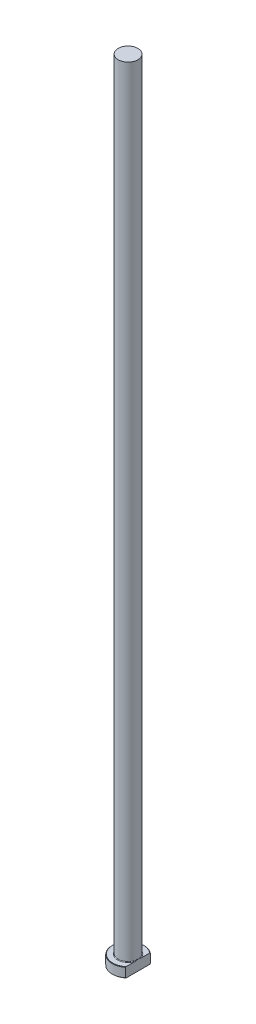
ISO-10303-21;
HEADER;
FILE_DESCRIPTION(('STEP AP214'),'2;1');
FILE_NAME('part.step','',(''),(''),'','','');
FILE_SCHEMA(('AUTOMOTIVE_DESIGN { 1 0 10303 214 1 1 1 1 }'));
ENDSEC;
DATA;
#1=APPLICATION_CONTEXT('core data for automotive mechanical design processes');
#2=APPLICATION_PROTOCOL_DEFINITION('international standard','automotive_design',2000,#1);
#3=PRODUCT_CONTEXT('',#1,'mechanical');
#4=PRODUCT('Part','Part','',(#3));
#5=PRODUCT_RELATED_PRODUCT_CATEGORY('part','',(#4));
#6=PRODUCT_DEFINITION_FORMATION('','',#4);
#7=PRODUCT_DEFINITION_CONTEXT('part definition',#1,'design');
#8=PRODUCT_DEFINITION('design','',#6,#7);
#9=PRODUCT_DEFINITION_SHAPE('','',#8);
#10=(LENGTH_UNIT() NAMED_UNIT(*) SI_UNIT(.MILLI.,.METRE.));
#11=(NAMED_UNIT(*) PLANE_ANGLE_UNIT() SI_UNIT($,.RADIAN.));
#12=(NAMED_UNIT(*) SI_UNIT($,.STERADIAN.) SOLID_ANGLE_UNIT());
#13=UNCERTAINTY_MEASURE_WITH_UNIT(LENGTH_MEASURE(1.E-05),#10,'distance_accuracy_value','');
#14=(GEOMETRIC_REPRESENTATION_CONTEXT(3) GLOBAL_UNCERTAINTY_ASSIGNED_CONTEXT((#13)) GLOBAL_UNIT_ASSIGNED_CONTEXT((#10,
#11,#12)) REPRESENTATION_CONTEXT('',''));
#15=CARTESIAN_POINT('',(0.,0.,0.));
#16=DIRECTION('',(0.,0.,1.));
#17=DIRECTION('',(1.,0.,0.));
#18=AXIS2_PLACEMENT_3D('',#15,#16,#17);
#19=CARTESIAN_POINT('',(0.,0.,0.));
#20=DIRECTION('',(0.,-1.,0.));
#21=DIRECTION('',(0.,0.,-1.));
#22=AXIS2_PLACEMENT_3D('',#19,#20,#21);
#23=PLANE('',#22);
#24=CARTESIAN_POINT('',(0.,0.,0.));
#25=DIRECTION('',(0.,-1.,0.));
#26=DIRECTION('',(0.,0.,-1.));
#27=AXIS2_PLACEMENT_3D('',#24,#25,#26);
#28=CIRCLE('',#27,7.79999999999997);
#29=CARTESIAN_POINT('',(4.99999999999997,0.,5.9866518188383));
#30=VERTEX_POINT('',#29);
#31=CARTESIAN_POINT('',(4.99999999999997,0.,-5.9866518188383));
#32=VERTEX_POINT('',#31);
#33=EDGE_CURVE('E98',#30,#32,#28,.T.);
#34=ORIENTED_EDGE('',*,*,#33,.T.);
#35=DIRECTION('',(0.,0.,1.));
#36=VECTOR('',#35,1.);
#37=CARTESIAN_POINT('',(4.99999999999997,0.,-6.24499799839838));
#38=LINE('',#37,#36);
#39=EDGE_CURVE('E83',#32,#30,#38,.T.);
#40=ORIENTED_EDGE('',*,*,#39,.T.);
#41=EDGE_LOOP('',(#34,#40));
#42=FACE_BOUND('',#41,.T.);
#43=ADVANCED_FACE('F32',(#42),#23,.T.);
#44=CARTESIAN_POINT('',(0.,259.958771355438,0.));
#45=DIRECTION('',(0.,1.,0.));
#46=DIRECTION('',(0.,0.,1.));
#47=AXIS2_PLACEMENT_3D('',#44,#45,#46);
#48=CYLINDRICAL_SURFACE('',#47,7.99999999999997);
#49=CARTESIAN_POINT('',(0.,4.79999999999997,0.));
#50=DIRECTION('',(0.,1.,0.));
#51=DIRECTION('',(0.,0.,1.));
#52=AXIS2_PLACEMENT_3D('',#49,#50,#51);
#53=CIRCLE('',#52,7.99999999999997);
#54=CARTESIAN_POINT('',(4.99999999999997,4.79999999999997,6.24499799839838));
#55=VERTEX_POINT('',#54);
#56=CARTESIAN_POINT('',(4.99999999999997,4.79999999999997,-6.24499799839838));
#57=VERTEX_POINT('',#56);
#58=EDGE_CURVE('E104',#55,#57,#53,.F.);
#59=ORIENTED_EDGE('',*,*,#58,.T.);
#60=DIRECTION('',(0.,-1.,0.));
#61=VECTOR('',#60,1.);
#62=CARTESIAN_POINT('',(4.99999999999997,400.,-6.24499799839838));
#63=LINE('',#62,#61);
#64=CARTESIAN_POINT('',(4.99999999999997,0.199999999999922,-6.24499799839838));
#65=VERTEX_POINT('',#64);
#66=EDGE_CURVE('E183',#57,#65,#63,.T.);
#67=ORIENTED_EDGE('',*,*,#66,.T.);
#68=CARTESIAN_POINT('',(0.,0.199999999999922,0.));
#69=DIRECTION('',(0.,-1.,0.));
#70=DIRECTION('',(0.,0.,-1.));
#71=AXIS2_PLACEMENT_3D('',#68,#69,#70);
#72=CIRCLE('',#71,7.99999999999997);
#73=CARTESIAN_POINT('',(4.99999999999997,0.199999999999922,6.24499799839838));
#74=VERTEX_POINT('',#73);
#75=EDGE_CURVE('E100',#65,#74,#72,.F.);
#76=ORIENTED_EDGE('',*,*,#75,.T.);
#77=DIRECTION('',(0.,-1.,0.));
#78=VECTOR('',#77,1.);
#79=CARTESIAN_POINT('',(4.99999999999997,400.,6.24499799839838));
#80=LINE('',#79,#78);
#81=EDGE_CURVE('E93',#55,#74,#80,.T.);
#82=ORIENTED_EDGE('',*,*,#81,.F.);
#83=EDGE_LOOP('',(#59,#67,#76,#82));
#84=FACE_BOUND('',#83,.T.);
#85=ADVANCED_FACE('F158',(#84),#48,.T.);
#86=CARTESIAN_POINT('',(-7.99999999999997,5.,0.));
#87=DIRECTION('',(0.,1.,0.));
#88=DIRECTION('',(0.,0.,1.));
#89=AXIS2_PLACEMENT_3D('',#86,#87,#88);
#90=PLANE('',#89);
#91=CARTESIAN_POINT('',(0.,5.,0.));
#92=DIRECTION('',(0.,1.,0.));
#93=DIRECTION('',(0.,0.,1.));
#94=AXIS2_PLACEMENT_3D('',#91,#92,#93);
#95=CIRCLE('',#94,7.79999999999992);
#96=CARTESIAN_POINT('',(4.99999999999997,5.,-5.98665181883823));
#97=VERTEX_POINT('',#96);
#98=CARTESIAN_POINT('',(4.99999999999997,5.,5.98665181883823));
#99=VERTEX_POINT('',#98);
#100=EDGE_CURVE('E178',#97,#99,#95,.T.);
#101=ORIENTED_EDGE('',*,*,#100,.T.);
#102=DIRECTION('',(0.,0.,-1.));
#103=VECTOR('',#102,1.);
#104=CARTESIAN_POINT('',(4.99999999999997,5.,0.));
#105=LINE('',#104,#103);
#106=CARTESIAN_POINT('',(4.99999999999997,4.99999999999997,1.75783958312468));
#107=VERTEX_POINT('',#106);
#108=EDGE_CURVE('E57',#99,#107,#105,.T.);
#109=ORIENTED_EDGE('',*,*,#108,.T.);
#110=CARTESIAN_POINT('',(0.,5.,0.));
#111=DIRECTION('',(0.,1.,0.));
#112=DIRECTION('',(0.,0.,1.));
#113=AXIS2_PLACEMENT_3D('',#110,#111,#112);
#114=CIRCLE('',#113,5.29999999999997);
#115=CARTESIAN_POINT('',(4.99999999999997,4.99999999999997,-1.75783958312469));
#116=VERTEX_POINT('',#115);
#117=EDGE_CURVE('E107',#107,#116,#114,.F.);
#118=ORIENTED_EDGE('',*,*,#117,.T.);
#119=EDGE_CURVE('E136',#116,#97,#105,.T.);
#120=ORIENTED_EDGE('',*,*,#119,.T.);
#121=EDGE_LOOP('',(#101,#109,#118,#120));
#122=FACE_BOUND('',#121,.T.);
#123=ADVANCED_FACE('F147',(#122),#90,.T.);
#124=CARTESIAN_POINT('',(0.,5.,0.));
#125=DIRECTION('',(0.,-1.,0.));
#126=DIRECTION('',(0.,0.,-1.));
#127=AXIS2_PLACEMENT_3D('',#124,#125,#126);
#128=CONICAL_SURFACE('',#127,7.79999999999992,0.785398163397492);
#129=ORIENTED_EDGE('',*,*,#58,.F.);
#130=CARTESIAN_POINT('',(4.99999999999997,-1.82162423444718,13.7401563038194));
#131=CARTESIAN_POINT('',(4.99999999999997,-1.61889813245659,13.5244204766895));
#132=CARTESIAN_POINT('',(4.99999999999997,-1.41646387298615,13.3084101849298));
#133=CARTESIAN_POINT('',(4.99999999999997,-1.01227657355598,12.8757508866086));
#134=CARTESIAN_POINT('',(4.99999999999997,-0.810523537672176,12.65910187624));
#135=CARTESIAN_POINT('',(4.99999999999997,-0.206157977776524,12.0077661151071));
#136=CARTESIAN_POINT('',(4.99999999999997,0.195280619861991,11.571988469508));
#137=CARTESIAN_POINT('',(4.99999999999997,1.00388282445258,10.6856136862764));
#138=CARTESIAN_POINT('',(4.99999999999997,1.41093902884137,10.234918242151));
#139=CARTESIAN_POINT('',(4.99999999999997,2.01658324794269,9.55471676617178));
#140=CARTESIAN_POINT('',(4.99999999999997,2.21758236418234,9.32735800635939));
#141=CARTESIAN_POINT('',(4.99999999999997,2.61761142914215,8.87091599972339));
#142=CARTESIAN_POINT('',(4.99999999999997,2.81664139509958,8.64183276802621));
#143=CARTESIAN_POINT('',(4.99999999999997,3.2121734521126,8.18170099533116));
#144=CARTESIAN_POINT('',(4.99999999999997,3.40867681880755,7.95065355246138));
#145=CARTESIAN_POINT('',(4.99999999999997,3.79865427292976,7.48599989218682));
#146=CARTESIAN_POINT('',(4.99999999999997,3.99212827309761,7.25239360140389));
#147=CARTESIAN_POINT('',(4.99999999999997,4.37558160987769,6.78155890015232));
#148=CARTESIAN_POINT('',(4.99999999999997,4.56555334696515,6.54432428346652));
#149=CARTESIAN_POINT('',(4.99999999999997,4.94042138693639,6.065895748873));
#150=CARTESIAN_POINT('',(4.99999999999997,5.12531810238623,5.82470215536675));
#151=CARTESIAN_POINT('',(4.99999999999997,5.48653546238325,5.33972956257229));
#152=CARTESIAN_POINT('',(4.99999999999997,5.66292392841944,5.09600137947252));
#153=CARTESIAN_POINT('',(4.99999999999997,6.00675382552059,4.60213647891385));
#154=CARTESIAN_POINT('',(4.99999999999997,6.17419169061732,4.35199726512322));
#155=CARTESIAN_POINT('',(4.99999999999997,6.49592993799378,3.84445040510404));
#156=CARTESIAN_POINT('',(4.99999999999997,6.65027272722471,3.58707012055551));
#157=CARTESIAN_POINT('',(4.99999999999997,6.86813414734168,3.1935659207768));
#158=CARTESIAN_POINT('',(4.99999999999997,6.93845533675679,3.06120993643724));
#159=CARTESIAN_POINT('',(4.99999999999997,7.07360441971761,2.79373319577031));
#160=CARTESIAN_POINT('',(4.99999999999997,7.1384331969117,2.65861288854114));
#161=CARTESIAN_POINT('',(4.99999999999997,7.26869642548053,2.3693638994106));
#162=CARTESIAN_POINT('',(4.99999999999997,7.33331212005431,2.21486278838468));
#163=CARTESIAN_POINT('',(4.99999999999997,7.45243473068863,1.90194073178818));
#164=CARTESIAN_POINT('',(4.99999999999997,7.50694001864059,1.74351915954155));
#165=CARTESIAN_POINT('',(4.99999999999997,7.60343746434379,1.42384276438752));
#166=CARTESIAN_POINT('',(4.99999999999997,7.64549910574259,1.26260921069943));
#167=CARTESIAN_POINT('',(4.99999999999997,7.71543089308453,0.937062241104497));
#168=CARTESIAN_POINT('',(4.99999999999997,7.74330266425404,0.77274918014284));
#169=CARTESIAN_POINT('',(4.99999999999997,7.78344284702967,0.439876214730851));
#170=CARTESIAN_POINT('',(4.99999999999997,7.79548961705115,0.271289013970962));
#171=CARTESIAN_POINT('',(4.99999999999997,7.80240809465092,-0.0662275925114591));
#172=CARTESIAN_POINT('',(4.99999999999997,7.79728142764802,-0.235156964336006));
#173=CARTESIAN_POINT('',(4.99999999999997,7.77017954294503,-0.572209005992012));
#174=CARTESIAN_POINT('',(4.99999999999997,7.74814735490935,-0.740327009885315));
#175=CARTESIAN_POINT('',(4.99999999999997,7.68863212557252,-1.07379849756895));
#176=CARTESIAN_POINT('',(4.99999999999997,7.65114437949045,-1.23915112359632));
#177=CARTESIAN_POINT('',(4.99999999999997,7.54734433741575,-1.62344926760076));
#178=CARTESIAN_POINT('',(4.99999999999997,7.47553580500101,-1.84089917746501));
#179=CARTESIAN_POINT('',(4.99999999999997,7.31300119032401,-2.26856946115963));
#180=CARTESIAN_POINT('',(4.99999999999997,7.22226460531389,-2.4787857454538));
#181=CARTESIAN_POINT('',(4.99999999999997,7.07492970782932,-2.79014067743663));
#182=CARTESIAN_POINT('',(4.99999999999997,7.02362278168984,-2.89384077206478));
#183=CARTESIAN_POINT('',(4.99999999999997,6.91783840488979,-3.0996162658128));
#184=CARTESIAN_POINT('',(4.99999999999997,6.86336091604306,-3.2016916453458));
#185=CARTESIAN_POINT('',(4.99999999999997,6.75169048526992,-3.40428995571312));
#186=CARTESIAN_POINT('',(4.99999999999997,6.69449856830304,-3.50481345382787));
#187=CARTESIAN_POINT('',(4.99999999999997,6.57774196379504,-3.70446206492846));
#188=CARTESIAN_POINT('',(4.99999999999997,6.51817739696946,-3.80358724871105));
#189=CARTESIAN_POINT('',(4.99999999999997,6.30853654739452,-4.1443576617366));
#190=CARTESIAN_POINT('',(4.99999999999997,6.15326588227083,-4.38281352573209));
#191=CARTESIAN_POINT('',(4.99999999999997,5.83377190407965,-4.85367607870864));
#192=CARTESIAN_POINT('',(4.99999999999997,5.66954595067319,-5.08608095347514));
#193=CARTESIAN_POINT('',(4.99999999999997,5.33431698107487,-5.54628554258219));
#194=CARTESIAN_POINT('',(4.99999999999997,5.16330740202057,-5.77408045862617));
#195=CARTESIAN_POINT('',(4.99999999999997,4.81629923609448,-6.22578157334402));
#196=CARTESIAN_POINT('',(4.99999999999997,4.64030119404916,-6.44968819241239));
#197=CARTESIAN_POINT('',(4.99999999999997,4.28368615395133,-6.89532578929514));
#198=CARTESIAN_POINT('',(4.99999999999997,4.1030528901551,-7.11704371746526));
#199=CARTESIAN_POINT('',(4.99999999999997,3.73870710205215,-7.55793799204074));
#200=CARTESIAN_POINT('',(4.99999999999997,3.55499450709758,-7.77711427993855));
#201=CARTESIAN_POINT('',(4.99999999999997,3.18521083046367,-8.21325328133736));
#202=CARTESIAN_POINT('',(4.99999999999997,2.99914113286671,-8.43021717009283));
#203=CARTESIAN_POINT('',(4.99999999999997,2.62499812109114,-8.86241167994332));
#204=CARTESIAN_POINT('',(4.99999999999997,2.43692478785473,-9.07764228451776));
#205=CARTESIAN_POINT('',(4.99999999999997,1.91463404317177,-9.67075518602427));
#206=CARTESIAN_POINT('',(4.99999999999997,1.57868086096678,-10.0471086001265));
#207=CARTESIAN_POINT('',(4.99999999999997,0.903003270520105,-10.7965122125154));
#208=CARTESIAN_POINT('',(4.99999999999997,0.563278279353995,-11.1695618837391));
#209=CARTESIAN_POINT('',(4.99999999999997,-0.116149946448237,-11.9100168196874));
#210=CARTESIAN_POINT('',(4.99999999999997,-0.455830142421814,-12.2774432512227));
#211=CARTESIAN_POINT('',(4.99999999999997,-1.1372864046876,-13.0102135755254));
#212=CARTESIAN_POINT('',(4.99999999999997,-1.47906204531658,-13.3755578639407));
#213=CARTESIAN_POINT('',(4.99999999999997,-1.82162423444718,-13.7401563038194));
#214=B_SPLINE_CURVE_WITH_KNOTS('',3,(#130,#131,#132,#133,#134,#135,#136,#137,#138,#139,#140,
#141,#142,#143,#144,#145,#146,#147,#148,#149,#150,#151,#152,#153,#154,#155,#156,#157,#158,#159,
#160,#161,#162,#163,#164,#165,#166,#167,#168,#169,#170,#171,#172,#173,#174,#175,#176,#177,#178,
#179,#180,#181,#182,#183,#184,#185,#186,#187,#188,#189,#190,#191,#192,#193,#194,#195,#196,#197,
#198,#199,#200,#201,#202,#203,#204,#205,#206,#207,#208,#209,#210,#211,#212,#213),.UNSPECIFIED.,
.F.,.F.,(4,2,2,2,2,2,2,2,2,2,2,2,2,2,2,2,2,2,2,2,2,2,2,2,2,2,2,2,2,2,2,2,2,2,2,2,2,2,2,2,2,4),
(0.,0.888120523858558,1.77624635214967,3.55372511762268,5.37559481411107,6.28598924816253,
7.19637570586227,8.10628289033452,9.01621623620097,9.92793449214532,10.8395784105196,
11.7420025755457,12.6447836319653,13.5445196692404,13.9940505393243,14.4435089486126,
14.9456212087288,15.4478142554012,15.947147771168,16.4464240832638,16.9526211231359,
17.4587702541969,17.966632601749,18.4746496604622,19.1604516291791,19.8466351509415,
20.1936870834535,20.5407431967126,20.8876692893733,21.2345777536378,22.0879097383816,
22.9414946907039,23.79592661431,24.6502655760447,25.5081848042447,26.3661237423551,
27.2235803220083,28.0810450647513,29.5944656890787,31.1081235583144,32.6092678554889,
34.1101167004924),.UNSPECIFIED.);
#215=EDGE_CURVE('E135',#55,#99,#214,.T.);
#216=ORIENTED_EDGE('',*,*,#215,.T.);
#217=ORIENTED_EDGE('',*,*,#100,.F.);
#218=EDGE_CURVE('E127',#97,#57,#214,.T.);
#219=ORIENTED_EDGE('',*,*,#218,.T.);
#220=EDGE_LOOP('',(#129,#216,#217,#219));
#221=FACE_BOUND('',#220,.T.);
#222=ADVANCED_FACE('F143',(#221),#128,.T.);
#223=CARTESIAN_POINT('',(0.,0.199999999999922,0.));
#224=DIRECTION('',(0.,1.,0.));
#225=DIRECTION('',(0.,0.,1.));
#226=AXIS2_PLACEMENT_3D('',#223,#224,#225);
#227=CONICAL_SURFACE('',#226,7.99999999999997,0.78539816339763);
#228=ORIENTED_EDGE('',*,*,#75,.F.);
#229=CARTESIAN_POINT('',(4.99999999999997,6.82162423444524,-13.7401563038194));
#230=CARTESIAN_POINT('',(4.99999999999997,6.61889813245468,-13.5244204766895));
#231=CARTESIAN_POINT('',(4.99999999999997,6.41646387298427,-13.3084101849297));
#232=CARTESIAN_POINT('',(4.99999999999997,6.01227657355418,-12.8757508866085));
#233=CARTESIAN_POINT('',(4.99999999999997,5.81052353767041,-12.6591018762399));
#234=CARTESIAN_POINT('',(4.99999999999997,5.20615797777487,-12.0077661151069));
#235=CARTESIAN_POINT('',(4.99999999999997,4.80471938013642,-11.5719884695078));
#236=CARTESIAN_POINT('',(4.99999999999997,3.99611717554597,-10.685613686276));
#237=CARTESIAN_POINT('',(4.99999999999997,3.58906097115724,-10.2349182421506));
#238=CARTESIAN_POINT('',(4.99999999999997,2.98341675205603,-9.55471676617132));
#239=CARTESIAN_POINT('',(4.99999999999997,2.7824176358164,-9.3273580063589));
#240=CARTESIAN_POINT('',(4.99999999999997,2.38238857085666,-8.87091599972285));
#241=CARTESIAN_POINT('',(4.99999999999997,2.18335860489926,-8.64183276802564));
#242=CARTESIAN_POINT('',(4.99999999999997,1.78782654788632,-8.18170099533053));
#243=CARTESIAN_POINT('',(4.99999999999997,1.59132318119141,-7.95065355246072));
#244=CARTESIAN_POINT('',(4.99999999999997,1.20134572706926,-7.48599989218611));
#245=CARTESIAN_POINT('',(4.99999999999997,1.00787172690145,-7.25239360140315));
#246=CARTESIAN_POINT('',(4.99999999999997,0.624418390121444,-6.78155890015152));
#247=CARTESIAN_POINT('',(4.99999999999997,0.434446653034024,-6.5443242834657));
#248=CARTESIAN_POINT('',(4.99999999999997,0.0595786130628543,-6.06589574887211));
#249=CARTESIAN_POINT('',(4.99999999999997,-0.125318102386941,-5.82470215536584));
#250=CARTESIAN_POINT('',(4.99999999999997,-0.486535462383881,-5.33972956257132));
#251=CARTESIAN_POINT('',(4.99999999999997,-0.662923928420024,-5.09600137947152));
#252=CARTESIAN_POINT('',(4.99999999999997,-1.00675382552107,-4.60213647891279));
#253=CARTESIAN_POINT('',(4.99999999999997,-1.17419169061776,-4.35199726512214));
#254=CARTESIAN_POINT('',(4.99999999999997,-1.49592993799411,-3.84445040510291));
#255=CARTESIAN_POINT('',(4.99999999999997,-1.65027272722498,-3.58707012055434));
#256=CARTESIAN_POINT('',(4.99999999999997,-1.86813414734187,-3.19356592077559));
#257=CARTESIAN_POINT('',(4.99999999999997,-1.93845533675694,-3.06120993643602));
#258=CARTESIAN_POINT('',(4.99999999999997,-2.07360441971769,-2.79373319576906));
#259=CARTESIAN_POINT('',(4.99999999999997,-2.13843319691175,-2.65861288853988));
#260=CARTESIAN_POINT('',(4.99999999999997,-2.26869642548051,-2.3693638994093));
#261=CARTESIAN_POINT('',(4.99999999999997,-2.33331212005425,-2.21486278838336));
#262=CARTESIAN_POINT('',(4.99999999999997,-2.45243473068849,-1.90194073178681));
#263=CARTESIAN_POINT('',(4.99999999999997,-2.50694001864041,-1.74351915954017));
#264=CARTESIAN_POINT('',(4.99999999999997,-2.60343746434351,-1.42384276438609));
#265=CARTESIAN_POINT('',(4.99999999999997,-2.64549910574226,-1.26260921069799));
#266=CARTESIAN_POINT('',(4.99999999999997,-2.7154308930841,-0.937062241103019));
#267=CARTESIAN_POINT('',(4.99999999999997,-2.74330266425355,-0.772749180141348));
#268=CARTESIAN_POINT('',(4.99999999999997,-2.78344284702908,-0.43987621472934));
#269=CARTESIAN_POINT('',(4.99999999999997,-2.79548961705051,-0.271289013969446));
#270=CARTESIAN_POINT('',(4.99999999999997,-2.80240809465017,0.0662275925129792));
#271=CARTESIAN_POINT('',(4.99999999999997,-2.79728142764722,0.235156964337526));
#272=CARTESIAN_POINT('',(4.99999999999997,-2.77017954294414,0.572209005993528));
#273=CARTESIAN_POINT('',(4.99999999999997,-2.74814735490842,0.740327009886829));
#274=CARTESIAN_POINT('',(4.99999999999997,-2.6886321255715,1.07379849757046));
#275=CARTESIAN_POINT('',(4.99999999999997,-2.65114437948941,1.23915112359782));
#276=CARTESIAN_POINT('',(4.99999999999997,-2.54734433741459,1.62344926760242));
#277=CARTESIAN_POINT('',(4.99999999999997,-2.47553580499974,1.84089917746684));
#278=CARTESIAN_POINT('',(4.99999999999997,-2.31300119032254,2.26856946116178));
#279=CARTESIAN_POINT('',(4.99999999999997,-2.22226460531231,2.4787857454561));
#280=CARTESIAN_POINT('',(4.99999999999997,-2.07492970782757,2.79014067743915));
#281=CARTESIAN_POINT('',(4.99999999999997,-2.02362278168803,2.89384077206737));
#282=CARTESIAN_POINT('',(4.99999999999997,-1.91783840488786,3.09961626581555));
#283=CARTESIAN_POINT('',(4.99999999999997,-1.86336091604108,3.20169164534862));
#284=CARTESIAN_POINT('',(4.99999999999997,-1.75169048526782,3.40428995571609));
#285=CARTESIAN_POINT('',(4.99999999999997,-1.69449856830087,3.50481345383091));
#286=CARTESIAN_POINT('',(4.99999999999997,-1.57774196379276,3.70446206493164));
#287=CARTESIAN_POINT('',(4.99999999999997,-1.51817739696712,3.80358724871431));
#288=CARTESIAN_POINT('',(4.99999999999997,-1.30853654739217,4.14435766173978));
#289=CARTESIAN_POINT('',(4.99999999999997,-1.15326588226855,4.38281352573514));
#290=CARTESIAN_POINT('',(4.99999999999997,-0.833771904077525,4.85367607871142));
#291=CARTESIAN_POINT('',(4.99999999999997,-0.669545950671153,5.0860809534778));
#292=CARTESIAN_POINT('',(4.99999999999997,-0.334316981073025,5.54628554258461));
#293=CARTESIAN_POINT('',(4.99999999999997,-0.163307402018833,5.77408045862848));
#294=CARTESIAN_POINT('',(4.99999999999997,0.183700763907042,6.2257815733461));
#295=CARTESIAN_POINT('',(4.99999999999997,0.359698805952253,6.44968819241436));
#296=CARTESIAN_POINT('',(4.99999999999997,0.716313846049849,6.8953257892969));
#297=CARTESIAN_POINT('',(4.99999999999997,0.896947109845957,7.11704371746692));
#298=CARTESIAN_POINT('',(4.99999999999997,1.26129289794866,7.55793799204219));
#299=CARTESIAN_POINT('',(4.99999999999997,1.44500549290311,7.7771142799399));
#300=CARTESIAN_POINT('',(4.99999999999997,1.81478916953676,8.21325328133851));
#301=CARTESIAN_POINT('',(4.99999999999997,2.00085886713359,8.43021717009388));
#302=CARTESIAN_POINT('',(4.99999999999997,2.3750018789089,8.86241167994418));
#303=CARTESIAN_POINT('',(4.99999999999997,2.56307521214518,9.07764228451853));
#304=CARTESIAN_POINT('',(4.99999999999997,3.08536595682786,9.67075518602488));
#305=CARTESIAN_POINT('',(4.99999999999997,3.42131913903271,10.047108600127));
#306=CARTESIAN_POINT('',(4.99999999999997,4.09699672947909,10.7965122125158));
#307=CARTESIAN_POINT('',(4.99999999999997,4.43672172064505,11.1695618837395));
#308=CARTESIAN_POINT('',(4.99999999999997,5.11614994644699,11.9100168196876));
#309=CARTESIAN_POINT('',(4.99999999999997,5.45583014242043,12.2774432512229));
#310=CARTESIAN_POINT('',(4.99999999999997,6.13728640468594,13.0102135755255));
#311=CARTESIAN_POINT('',(4.99999999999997,6.47906204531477,13.3755578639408));
#312=CARTESIAN_POINT('',(4.99999999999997,6.82162423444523,13.7401563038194));
#313=B_SPLINE_CURVE_WITH_KNOTS('',3,(#229,#230,#231,#232,#233,#234,#235,#236,#237,#238,#239,
#240,#241,#242,#243,#244,#245,#246,#247,#248,#249,#250,#251,#252,#253,#254,#255,#256,#257,#258,
#259,#260,#261,#262,#263,#264,#265,#266,#267,#268,#269,#270,#271,#272,#273,#274,#275,#276,#277,
#278,#279,#280,#281,#282,#283,#284,#285,#286,#287,#288,#289,#290,#291,#292,#293,#294,#295,#296,
#297,#298,#299,#300,#301,#302,#303,#304,#305,#306,#307,#308,#309,#310,#311,#312),.UNSPECIFIED.,
.F.,.F.,(4,2,2,2,2,2,2,2,2,2,2,2,2,2,2,2,2,2,2,2,2,2,2,2,2,2,2,2,2,2,2,2,2,2,2,2,2,2,2,2,2,4),
(0.,0.888120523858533,1.77624635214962,3.55372511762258,5.37559481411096,6.28598924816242,
7.19637570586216,8.1062828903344,9.01621623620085,9.9279344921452,10.8395784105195,
11.7420025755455,12.6447836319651,13.5445196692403,13.9940505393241,14.4435089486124,
14.9456212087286,15.447814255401,15.9471477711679,16.4464240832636,16.9526211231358,
17.4587702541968,17.9666326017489,18.4746496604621,19.1604516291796,19.8466351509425,
20.1936870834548,20.5407431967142,20.8876692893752,21.2345777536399,22.0879097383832,
22.9414946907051,23.7959266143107,24.650265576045,25.5081848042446,26.3661237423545,
27.2235803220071,28.0810450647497,29.5944656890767,31.108123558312,32.609267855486,
34.1101167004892),.UNSPECIFIED.);
#314=EDGE_CURVE('E86',#65,#32,#313,.T.);
#315=ORIENTED_EDGE('',*,*,#314,.T.);
#316=ORIENTED_EDGE('',*,*,#33,.F.);
#317=EDGE_CURVE('E89',#30,#74,#313,.T.);
#318=ORIENTED_EDGE('',*,*,#317,.T.);
#319=EDGE_LOOP('',(#228,#315,#316,#318));
#320=FACE_BOUND('',#319,.T.);
#321=ADVANCED_FACE('F97',(#320),#227,.T.);
#322=CARTESIAN_POINT('',(0.,5.29999999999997,0.));
#323=DIRECTION('',(0.,1.,0.));
#324=DIRECTION('',(0.,0.,1.));
#325=AXIS2_PLACEMENT_3D('',#322,#323,#324);
#326=TOROIDAL_SURFACE('',#325,5.29999999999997,0.3);
#327=CARTESIAN_POINT('',(4.99999999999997,5.29999999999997,0.));
#328=CARTESIAN_POINT('',(4.99999999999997,5.30000062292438,1.31469639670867E-10));
#329=CARTESIAN_POINT('',(4.99999999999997,5.30000124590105,-2.52759209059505E-07));
#330=CARTESIAN_POINT('',(4.99999999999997,5.30000240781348,-9.47164325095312E-07));
#331=CARTESIAN_POINT('',(4.99999999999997,5.30000293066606,-1.40594036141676E-06));
#332=CARTESIAN_POINT('',(4.99999999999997,5.30000402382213,-2.50637603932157E-06));
#333=CARTESIAN_POINT('',(4.99999999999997,5.30000457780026,-3.16588904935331E-06));
#334=CARTESIAN_POINT('',(4.99999999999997,5.30000556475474,-4.52859961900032E-06));
#335=CARTESIAN_POINT('',(4.99999999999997,5.30000600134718,-5.22939444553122E-06));
#336=CARTESIAN_POINT('',(4.99999999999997,5.30000763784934,-7.9612197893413E-06));
#337=CARTESIAN_POINT('',(4.99999999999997,5.30000875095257,-1.0047740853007E-05));
#338=CARTESIAN_POINT('',(4.99999999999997,5.3000105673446,-1.4166087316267E-05));
#339=CARTESIAN_POINT('',(4.99999999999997,5.30001129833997,-1.6186178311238E-05));
#340=CARTESIAN_POINT('',(4.99999999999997,5.30001439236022,-2.47865739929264E-05));
#341=CARTESIAN_POINT('',(4.99999999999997,5.30001672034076,-3.13830281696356E-05));
#342=CARTESIAN_POINT('',(4.99999999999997,5.30002012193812,-4.38084218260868E-05));
#343=CARTESIAN_POINT('',(4.99999999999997,5.30002133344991,-4.95992737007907E-05));
#344=CARTESIAN_POINT('',(4.99999999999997,5.30003020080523,-9.27862610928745E-05));
#345=CARTESIAN_POINT('',(4.99999999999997,5.30003696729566,-0.000130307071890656));
#346=CARTESIAN_POINT('',(4.99999999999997,5.30006659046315,-0.000278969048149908));
#347=CARTESIAN_POINT('',(4.99999999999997,5.30009481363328,-0.000389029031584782));
#348=CARTESIAN_POINT('',(4.99999999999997,5.30020506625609,-0.000826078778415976));
#349=CARTESIAN_POINT('',(4.99999999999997,5.30028365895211,-0.00115365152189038));
#350=CARTESIAN_POINT('',(4.99999999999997,5.3005991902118,-0.00245925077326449));
#351=CARTESIAN_POINT('',(4.99999999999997,5.30084048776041,-0.00343651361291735));
#352=CARTESIAN_POINT('',(4.99999999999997,5.30184626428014,-0.00752058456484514));
#353=CARTESIAN_POINT('',(4.99999999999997,5.30260525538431,-0.0106283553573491));
#354=CARTESIAN_POINT('',(4.99999999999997,5.30996461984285,-0.0407482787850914));
#355=CARTESIAN_POINT('',(4.99999999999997,5.31658985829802,-0.0677561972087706));
#356=CARTESIAN_POINT('',(4.99999999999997,5.32953319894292,-0.120688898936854));
#357=CARTESIAN_POINT('',(4.99999999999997,5.33585289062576,-0.146613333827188));
#358=CARTESIAN_POINT('',(4.99999999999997,5.34926050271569,-0.201795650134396));
#359=CARTESIAN_POINT('',(4.99999999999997,5.35634306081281,-0.231054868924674));
#360=CARTESIAN_POINT('',(4.99999999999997,5.37050252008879,-0.289917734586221));
#361=CARTESIAN_POINT('',(4.99999999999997,5.37757848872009,-0.319521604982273));
#362=CARTESIAN_POINT('',(4.99999999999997,5.39452602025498,-0.391032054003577));
#363=CARTESIAN_POINT('',(4.99999999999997,5.40434071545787,-0.432952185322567));
#364=CARTESIAN_POINT('',(4.99999999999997,5.42340141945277,-0.515763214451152));
#365=CARTESIAN_POINT('',(4.99999999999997,5.43265559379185,-0.556652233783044));
#366=CARTESIAN_POINT('',(4.99999999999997,5.45710553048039,-0.667075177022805));
#367=CARTESIAN_POINT('',(4.99999999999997,5.47194176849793,-0.736689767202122));
#368=CARTESIAN_POINT('',(4.99999999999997,5.50018229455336,-0.876836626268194));
#369=CARTESIAN_POINT('',(4.99999999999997,5.51357312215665,-0.947371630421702));
#370=CARTESIAN_POINT('',(4.99999999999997,5.53930921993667,-1.09497328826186));
#371=CARTESIAN_POINT('',(4.99999999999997,5.55146217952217,-1.17207432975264));
#372=CARTESIAN_POINT('',(4.99999999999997,5.57239669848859,-1.32672649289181));
#373=CARTESIAN_POINT('',(4.99999999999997,5.58117877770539,-1.40427754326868));
#374=CARTESIAN_POINT('',(4.99999999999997,5.594997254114,-1.5687382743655));
#375=CARTESIAN_POINT('',(4.99999999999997,5.59948802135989,-1.65570044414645));
#376=CARTESIAN_POINT('',(4.99999999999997,5.60018885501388,-1.78535304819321));
#377=CARTESIAN_POINT('',(4.99999999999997,5.59945214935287,-1.82802575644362));
#378=CARTESIAN_POINT('',(4.99999999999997,5.59559364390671,-1.91325081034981));
#379=CARTESIAN_POINT('',(4.99999999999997,5.59247319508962,-1.95580321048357));
#380=CARTESIAN_POINT('',(4.99999999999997,5.5838324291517,-2.03512365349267));
#381=CARTESIAN_POINT('',(4.99999999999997,5.57867386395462,-2.07192937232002));
#382=CARTESIAN_POINT('',(4.99999999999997,5.56543793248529,-2.1452675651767));
#383=CARTESIAN_POINT('',(4.99999999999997,5.55734203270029,-2.18179676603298));
#384=CARTESIAN_POINT('',(4.99999999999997,5.53718005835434,-2.25427226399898));
#385=CARTESIAN_POINT('',(4.99999999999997,5.52507057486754,-2.29020746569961));
#386=CARTESIAN_POINT('',(4.99999999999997,5.50270928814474,-2.34223029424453));
#387=CARTESIAN_POINT('',(4.99999999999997,5.4945781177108,-2.35922314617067));
#388=CARTESIAN_POINT('',(4.99999999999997,5.47657809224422,-2.39224900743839));
#389=CARTESIAN_POINT('',(4.99999999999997,5.46671281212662,-2.40828390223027));
#390=CARTESIAN_POINT('',(4.99999999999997,5.44695893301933,-2.43579467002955));
#391=CARTESIAN_POINT('',(4.99999999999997,5.43745879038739,-2.44754592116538));
#392=CARTESIAN_POINT('',(4.99999999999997,5.41677914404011,-2.46946476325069));
#393=CARTESIAN_POINT('',(4.99999999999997,5.40560543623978,-2.47963758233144));
#394=CARTESIAN_POINT('',(4.99999999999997,5.38617750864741,-2.49393642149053));
#395=CARTESIAN_POINT('',(4.99999999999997,5.37851643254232,-2.49886271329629));
#396=CARTESIAN_POINT('',(4.99999999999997,5.36252740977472,-2.50749953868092));
#397=CARTESIAN_POINT('',(4.99999999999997,5.35419984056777,-2.51121075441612));
#398=CARTESIAN_POINT('',(4.99999999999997,5.33690648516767,-2.51712941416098));
#399=CARTESIAN_POINT('',(4.99999999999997,5.32793451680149,-2.51931927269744));
#400=CARTESIAN_POINT('',(4.99999999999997,5.30973576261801,-2.52185978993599));
#401=CARTESIAN_POINT('',(4.99999999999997,5.30050931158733,-2.52221275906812));
#402=CARTESIAN_POINT('',(4.99999999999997,5.28349166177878,-2.52112455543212));
#403=CARTESIAN_POINT('',(4.99999999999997,5.27568322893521,-2.519931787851));
#404=CARTESIAN_POINT('',(4.99999999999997,5.26036860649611,-2.51628294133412));
#405=CARTESIAN_POINT('',(4.99999999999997,5.25286261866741,-2.51382603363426));
#406=CARTESIAN_POINT('',(4.99999999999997,5.23590266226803,-2.50685484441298));
#407=CARTESIAN_POINT('',(4.99999999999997,5.22661875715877,-2.50192984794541));
#408=CARTESIAN_POINT('',(4.99999999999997,5.20895514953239,-2.49066548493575));
#409=CARTESIAN_POINT('',(4.99999999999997,5.2005775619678,-2.48432291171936));
#410=CARTESIAN_POINT('',(4.99999999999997,5.17987008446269,-2.46645212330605));
#411=CARTESIAN_POINT('',(4.99999999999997,5.1682415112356,-2.45411867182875));
#412=CARTESIAN_POINT('',(4.99999999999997,5.14692461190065,-2.42790849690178));
#413=CARTESIAN_POINT('',(4.99999999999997,5.13723987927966,-2.41402898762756));
#414=CARTESIAN_POINT('',(4.99999999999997,5.11080706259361,-2.37143175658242));
#415=CARTESIAN_POINT('',(4.99999999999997,5.09628770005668,-2.3413470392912));
#416=CARTESIAN_POINT('',(4.99999999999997,5.07130349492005,-2.27940731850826));
#417=CARTESIAN_POINT('',(4.99999999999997,5.06087110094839,-2.24754035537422));
#418=CARTESIAN_POINT('',(4.99999999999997,5.03890359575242,-2.16787245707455));
#419=CARTESIAN_POINT('',(4.99999999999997,5.02913523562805,-2.11959065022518));
#420=CARTESIAN_POINT('',(4.99999999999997,5.01416953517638,-2.0222492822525));
#421=CARTESIAN_POINT('',(4.99999999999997,5.00898637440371,-1.97318778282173));
#422=CARTESIAN_POINT('',(4.99999999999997,5.00220823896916,-1.87635767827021));
#423=CARTESIAN_POINT('',(4.99999999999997,5.00050709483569,-1.82859609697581));
#424=CARTESIAN_POINT('',(4.99999999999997,4.99969104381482,-1.73330165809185));
#425=CARTESIAN_POINT('',(4.99999999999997,5.00056327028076,-1.68576884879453));
#426=CARTESIAN_POINT('',(4.99999999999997,5.0048429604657,-1.57937770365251));
#427=CARTESIAN_POINT('',(4.99999999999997,5.00880932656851,-1.52054285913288));
#428=CARTESIAN_POINT('',(4.99999999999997,5.01925964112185,-1.40312974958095));
#429=CARTESIAN_POINT('',(4.99999999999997,5.02574264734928,-1.3445513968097));
#430=CARTESIAN_POINT('',(4.99999999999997,5.04090087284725,-1.2262766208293));
#431=CARTESIAN_POINT('',(4.99999999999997,5.04962425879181,-1.16658647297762));
#432=CARTESIAN_POINT('',(4.99999999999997,5.06877923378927,-1.04732463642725));
#433=CARTESIAN_POINT('',(4.99999999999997,5.07921523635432,-0.987753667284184));
#434=CARTESIAN_POINT('',(4.99999999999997,5.10551698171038,-0.846936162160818));
#435=CARTESIAN_POINT('',(4.99999999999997,5.1219656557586,-0.765799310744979));
#436=CARTESIAN_POINT('',(4.99999999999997,5.15639716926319,-0.604819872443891));
#437=CARTESIAN_POINT('',(4.99999999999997,5.17436050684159,-0.52497303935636));
#438=CARTESIAN_POINT('',(4.99999999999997,5.20921667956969,-0.374726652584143));
#439=CARTESIAN_POINT('',(4.99999999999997,5.22599388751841,-0.304300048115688));
#440=CARTESIAN_POINT('',(4.99999999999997,5.25191105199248,-0.196907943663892));
#441=CARTESIAN_POINT('',(4.99999999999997,5.26090146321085,-0.159905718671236));
#442=CARTESIAN_POINT('',(4.99999999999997,5.27881854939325,-0.0865164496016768));
#443=CARTESIAN_POINT('',(4.99999999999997,5.28774391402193,-0.0501291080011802));
#444=CARTESIAN_POINT('',(4.99999999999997,5.29739627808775,-0.0106218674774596));
#445=CARTESIAN_POINT('',(4.99999999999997,5.29815688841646,-0.00750762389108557));
#446=CARTESIAN_POINT('',(4.99999999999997,5.29916304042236,-0.00342209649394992));
#447=CARTESIAN_POINT('',(4.99999999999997,5.29940309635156,-0.0024498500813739));
#448=CARTESIAN_POINT('',(4.99999999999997,5.29971711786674,-0.0011504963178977));
#449=CARTESIAN_POINT('',(4.99999999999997,5.29979541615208,-0.00082414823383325));
#450=CARTESIAN_POINT('',(4.99999999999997,5.29990531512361,-0.000388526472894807));
#451=CARTESIAN_POINT('',(4.99999999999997,5.29993348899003,-0.000278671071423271));
#452=CARTESIAN_POINT('',(4.99999999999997,5.29996306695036,-0.000130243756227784));
#453=CARTESIAN_POINT('',(4.99999999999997,5.29996982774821,-9.27511375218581E-05));
#454=CARTESIAN_POINT('',(4.99999999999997,5.29997868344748,-4.95929886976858E-05));
#455=CARTESIAN_POINT('',(4.99999999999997,5.29997989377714,-4.38036552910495E-05));
#456=CARTESIAN_POINT('',(4.99999999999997,5.29998329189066,-3.13814183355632E-05));
#457=CARTESIAN_POINT('',(4.99999999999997,5.2999856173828,-2.47865218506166E-05));
#458=CARTESIAN_POINT('',(4.99999999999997,5.2999887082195,-1.61877546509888E-05));
#459=CARTESIAN_POINT('',(4.99999999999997,5.29998943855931,-1.41677768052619E-05));
#460=CARTESIAN_POINT('',(4.99999999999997,5.29999125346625,-1.00495529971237E-05));
#461=CARTESIAN_POINT('',(4.99999999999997,5.29999236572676,-7.96302653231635E-06));
#462=CARTESIAN_POINT('',(4.99999999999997,5.29999400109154,-5.23107414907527E-06));
#463=CARTESIAN_POINT('',(4.99999999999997,5.29999443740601,-4.5302103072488E-06));
#464=CARTESIAN_POINT('',(4.99999999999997,5.29999542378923,-3.16731152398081E-06));
#465=CARTESIAN_POINT('',(4.99999999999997,5.29999597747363,-2.50767724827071E-06));
#466=CARTESIAN_POINT('',(4.99999999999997,5.2999970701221,-1.40695877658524E-06));
#467=CARTESIAN_POINT('',(4.99999999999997,5.29999759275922,-9.48032429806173E-07));
#468=CARTESIAN_POINT('',(4.99999999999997,5.29999875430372,-2.53244317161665E-07));
#469=CARTESIAN_POINT('',(4.99999999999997,5.29999937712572,-1.31459052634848E-10));
#470=CARTESIAN_POINT('',(4.99999999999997,5.29999999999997,0.));
#471=B_SPLINE_CURVE_WITH_KNOTS('',3,(#327,#328,#329,#330,#331,#332,#333,#334,#335,#336,#337,
#338,#339,#340,#341,#342,#343,#344,#345,#346,#347,#348,#349,#350,#351,#352,#353,#354,#355,#356,
#357,#358,#359,#360,#361,#362,#363,#364,#365,#366,#367,#368,#369,#370,#371,#372,#373,#374,#375,
#376,#377,#378,#379,#380,#381,#382,#383,#384,#385,#386,#387,#388,#389,#390,#391,#392,#393,#394,
#395,#396,#397,#398,#399,#400,#401,#402,#403,#404,#405,#406,#407,#408,#409,#410,#411,#412,#413,
#414,#415,#416,#417,#418,#419,#420,#421,#422,#423,#424,#425,#426,#427,#428,#429,#430,#431,#432,
#433,#434,#435,#436,#437,#438,#439,#440,#441,#442,#443,#444,#445,#446,#447,#448,#449,#450,#451,
#452,#453,#454,#455,#456,#457,#458,#459,#460,#461,#462,#463,#464,#465,#466,#467,#468,#469,#470),
.UNSPECIFIED.,.T.,.F.,(4,2,2,2,2,2,2,2,2,2,2,2,2,2,2,2,2,2,2,2,2,2,2,2,2,2,2,2,2,2,2,2,2,2,2,2,
2,2,2,2,2,2,2,2,2,2,2,2,2,2,2,2,2,2,2,2,2,2,2,2,2,2,2,2,2,2,2,2,2,2,2,4),(0.,
1.88939317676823E-06,3.98058917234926E-06,6.54818564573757E-06,9.0240439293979E-06,
1.60938750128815E-05,2.25328198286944E-05,4.34843921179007E-05,6.12120199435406E-05,
0.000175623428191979,0.000516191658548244,0.00152710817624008,0.00454656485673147,
0.0141443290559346,0.0975679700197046,0.1776193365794,0.267931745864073,0.359245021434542,
0.488405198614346,0.614173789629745,0.827694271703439,1.04305715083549,1.27715608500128,
1.51121890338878,1.77214751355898,1.90013509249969,2.02805018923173,2.13945459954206,
2.25157451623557,2.36494894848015,2.4213923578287,2.47772074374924,2.52293802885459,
2.5680021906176,2.59524342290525,2.62246933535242,2.65000494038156,2.67750590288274,
2.70108948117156,2.72468854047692,2.75603978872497,2.78746268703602,2.83802806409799,
2.88868607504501,2.98834295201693,3.08877575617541,3.23618650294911,3.38405153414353,
3.52733651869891,3.66990630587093,3.84673903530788,4.02350562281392,4.204447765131,
4.38586374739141,4.63419556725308,4.87971270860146,5.09690175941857,5.2111388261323,
5.32353360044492,5.33315137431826,5.33615533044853,5.33716246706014,5.33750240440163,
5.33761672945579,5.33763445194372,5.33765539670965,5.33766183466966,5.33766890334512,
5.33767137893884,5.3376739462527,5.33767603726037,5.3376779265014),.UNSPECIFIED.);
#472=CARTESIAN_POINT('',(4.99999999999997,5.29999999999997,0.));
#473=VERTEX_POINT('',#472);
#474=EDGE_CURVE('E11',#116,#473,#471,.T.);
#475=ORIENTED_EDGE('',*,*,#474,.F.);
#476=ORIENTED_EDGE('',*,*,#117,.F.);
#477=CARTESIAN_POINT('',(4.99999999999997,5.29999999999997,0.));
#478=CARTESIAN_POINT('',(4.99999999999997,5.29999937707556,-1.31469681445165E-10));
#479=CARTESIAN_POINT('',(4.99999999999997,5.29999875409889,2.52759208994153E-07));
#480=CARTESIAN_POINT('',(4.99999999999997,5.29999759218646,9.47164324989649E-07));
#481=CARTESIAN_POINT('',(4.99999999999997,5.29999706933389,1.40594036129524E-06));
#482=CARTESIAN_POINT('',(4.99999999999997,5.29999597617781,2.50637603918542E-06));
#483=CARTESIAN_POINT('',(4.99999999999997,5.29999542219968,3.16588904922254E-06));
#484=CARTESIAN_POINT('',(4.99999999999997,5.29999443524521,4.52859961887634E-06));
#485=CARTESIAN_POINT('',(4.99999999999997,5.29999399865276,5.22939444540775E-06));
#486=CARTESIAN_POINT('',(4.99999999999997,5.2999923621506,7.96121978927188E-06));
#487=CARTESIAN_POINT('',(4.99999999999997,5.29999124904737,1.00477408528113E-05));
#488=CARTESIAN_POINT('',(4.99999999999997,5.29998943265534,1.41660873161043E-05));
#489=CARTESIAN_POINT('',(4.99999999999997,5.29998870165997,1.61861783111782E-05));
#490=CARTESIAN_POINT('',(4.99999999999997,5.29998560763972,2.47865739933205E-05));
#491=CARTESIAN_POINT('',(4.99999999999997,5.29998327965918,3.13830281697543E-05));
#492=CARTESIAN_POINT('',(4.99999999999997,5.29997987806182,4.38084218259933E-05));
#493=CARTESIAN_POINT('',(4.99999999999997,5.29997866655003,4.95992737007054E-05));
#494=CARTESIAN_POINT('',(4.99999999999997,5.29996979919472,9.27862610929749E-05));
#495=CARTESIAN_POINT('',(4.99999999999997,5.29996303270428,0.000130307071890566));
#496=CARTESIAN_POINT('',(4.99999999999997,5.29993340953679,0.000278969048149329));
#497=CARTESIAN_POINT('',(4.99999999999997,5.29990518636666,0.000389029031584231));
#498=CARTESIAN_POINT('',(4.99999999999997,5.29979493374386,0.000826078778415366));
#499=CARTESIAN_POINT('',(4.99999999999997,5.29971634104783,0.00115365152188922));
#500=CARTESIAN_POINT('',(4.99999999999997,5.29940080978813,0.00245925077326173));
#501=CARTESIAN_POINT('',(4.99999999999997,5.29915951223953,0.00343651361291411));
#502=CARTESIAN_POINT('',(4.99999999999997,5.29815373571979,0.00752058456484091));
#503=CARTESIAN_POINT('',(4.99999999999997,5.29739474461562,0.0106283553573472));
#504=CARTESIAN_POINT('',(4.99999999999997,5.29003538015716,0.040748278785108));
#505=CARTESIAN_POINT('',(4.99999999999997,5.28341014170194,0.0677561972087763));
#506=CARTESIAN_POINT('',(4.99999999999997,5.270466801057,0.120688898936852));
#507=CARTESIAN_POINT('',(4.99999999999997,5.26414710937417,0.146613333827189));
#508=CARTESIAN_POINT('',(4.99999999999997,5.25073949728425,0.201795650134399));
#509=CARTESIAN_POINT('',(4.99999999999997,5.24365693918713,0.231054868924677));
#510=CARTESIAN_POINT('',(4.99999999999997,5.22949747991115,0.289917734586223));
#511=CARTESIAN_POINT('',(4.99999999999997,5.22242151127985,0.319521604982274));
#512=CARTESIAN_POINT('',(4.99999999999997,5.20547397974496,0.391032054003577));
#513=CARTESIAN_POINT('',(4.99999999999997,5.19565928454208,0.432952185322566));
#514=CARTESIAN_POINT('',(4.99999999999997,5.17659858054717,0.515763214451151));
#515=CARTESIAN_POINT('',(4.99999999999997,5.16734440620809,0.556652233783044));
#516=CARTESIAN_POINT('',(4.99999999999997,5.14289446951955,0.667075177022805));
#517=CARTESIAN_POINT('',(4.99999999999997,5.12805823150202,0.736689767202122));
#518=CARTESIAN_POINT('',(4.99999999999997,5.09981770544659,0.876836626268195));
#519=CARTESIAN_POINT('',(4.99999999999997,5.08642687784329,0.947371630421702));
#520=CARTESIAN_POINT('',(4.99999999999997,5.06069078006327,1.09497328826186));
#521=CARTESIAN_POINT('',(4.99999999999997,5.04853782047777,1.17207432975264));
#522=CARTESIAN_POINT('',(4.99999999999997,5.02760330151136,1.32672649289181));
#523=CARTESIAN_POINT('',(4.99999999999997,5.01882122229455,1.40427754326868));
#524=CARTESIAN_POINT('',(4.99999999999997,5.00500274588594,1.5687382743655));
#525=CARTESIAN_POINT('',(4.99999999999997,5.00051197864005,1.65570044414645));
#526=CARTESIAN_POINT('',(4.99999999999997,4.99981114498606,1.78535304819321));
#527=CARTESIAN_POINT('',(4.99999999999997,5.00054785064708,1.82802575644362));
#528=CARTESIAN_POINT('',(4.99999999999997,5.00440635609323,1.91325081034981));
#529=CARTESIAN_POINT('',(4.99999999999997,5.00752680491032,1.95580321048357));
#530=CARTESIAN_POINT('',(4.99999999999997,5.01616757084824,2.03512365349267));
#531=CARTESIAN_POINT('',(4.99999999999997,5.02132613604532,2.07192937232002));
#532=CARTESIAN_POINT('',(4.99999999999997,5.03456206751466,2.1452675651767));
#533=CARTESIAN_POINT('',(4.99999999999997,5.04265796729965,2.18179676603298));
#534=CARTESIAN_POINT('',(4.99999999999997,5.0628199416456,2.25427226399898));
#535=CARTESIAN_POINT('',(4.99999999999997,5.07492942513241,2.29020746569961));
#536=CARTESIAN_POINT('',(4.99999999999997,5.09729071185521,2.34223029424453));
#537=CARTESIAN_POINT('',(4.99999999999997,5.10542188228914,2.35922314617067));
#538=CARTESIAN_POINT('',(4.99999999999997,5.12342190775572,2.39224900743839));
#539=CARTESIAN_POINT('',(4.99999999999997,5.13328718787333,2.40828390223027));
#540=CARTESIAN_POINT('',(4.99999999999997,5.15304106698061,2.43579467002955));
#541=CARTESIAN_POINT('',(4.99999999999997,5.16254120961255,2.44754592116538));
#542=CARTESIAN_POINT('',(4.99999999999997,5.18322085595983,2.46946476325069));
#543=CARTESIAN_POINT('',(4.99999999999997,5.19439456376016,2.47963758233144));
#544=CARTESIAN_POINT('',(4.99999999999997,5.21382249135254,2.49393642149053));
#545=CARTESIAN_POINT('',(4.99999999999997,5.22148356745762,2.49886271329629));
#546=CARTESIAN_POINT('',(4.99999999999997,5.23747259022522,2.50749953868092));
#547=CARTESIAN_POINT('',(4.99999999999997,5.24580015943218,2.51121075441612));
#548=CARTESIAN_POINT('',(4.99999999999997,5.26309351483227,2.51712941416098));
#549=CARTESIAN_POINT('',(4.99999999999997,5.27206548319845,2.51931927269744));
#550=CARTESIAN_POINT('',(4.99999999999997,5.29026423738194,2.52185978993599));
#551=CARTESIAN_POINT('',(4.99999999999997,5.29949068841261,2.52221275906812));
#552=CARTESIAN_POINT('',(4.99999999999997,5.31650833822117,2.52112455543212));
#553=CARTESIAN_POINT('',(4.99999999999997,5.32431677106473,2.519931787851));
#554=CARTESIAN_POINT('',(4.99999999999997,5.33963139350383,2.51628294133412));
#555=CARTESIAN_POINT('',(4.99999999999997,5.34713738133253,2.51382603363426));
#556=CARTESIAN_POINT('',(4.99999999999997,5.36409733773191,2.50685484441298));
#557=CARTESIAN_POINT('',(4.99999999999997,5.37338124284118,2.50192984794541));
#558=CARTESIAN_POINT('',(4.99999999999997,5.39104485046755,2.49066548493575));
#559=CARTESIAN_POINT('',(4.99999999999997,5.39942243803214,2.48432291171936));
#560=CARTESIAN_POINT('',(4.99999999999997,5.42012991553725,2.46645212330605));
#561=CARTESIAN_POINT('',(4.99999999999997,5.43175848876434,2.45411867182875));
#562=CARTESIAN_POINT('',(4.99999999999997,5.4530753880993,2.42790849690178));
#563=CARTESIAN_POINT('',(4.99999999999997,5.46276012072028,2.41402898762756));
#564=CARTESIAN_POINT('',(4.99999999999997,5.48919293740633,2.37143175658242));
#565=CARTESIAN_POINT('',(4.99999999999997,5.50371229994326,2.3413470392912));
#566=CARTESIAN_POINT('',(4.99999999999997,5.52869650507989,2.27940731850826));
#567=CARTESIAN_POINT('',(4.99999999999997,5.53912889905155,2.24754035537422));
#568=CARTESIAN_POINT('',(4.99999999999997,5.56109640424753,2.16787245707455));
#569=CARTESIAN_POINT('',(4.99999999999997,5.57086476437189,2.11959065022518));
#570=CARTESIAN_POINT('',(4.99999999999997,5.58583046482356,2.0222492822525));
#571=CARTESIAN_POINT('',(4.99999999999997,5.59101362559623,1.97318778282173));
#572=CARTESIAN_POINT('',(4.99999999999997,5.59779176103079,1.87635767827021));
#573=CARTESIAN_POINT('',(4.99999999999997,5.59949290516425,1.82859609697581));
#574=CARTESIAN_POINT('',(4.99999999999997,5.60030895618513,1.73330165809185));
#575=CARTESIAN_POINT('',(4.99999999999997,5.59943672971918,1.68576884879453));
#576=CARTESIAN_POINT('',(4.99999999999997,5.59515703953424,1.57937770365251));
#577=CARTESIAN_POINT('',(4.99999999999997,5.59119067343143,1.52054285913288));
#578=CARTESIAN_POINT('',(4.99999999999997,5.58074035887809,1.40312974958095));
#579=CARTESIAN_POINT('',(4.99999999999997,5.57425735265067,1.3445513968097));
#580=CARTESIAN_POINT('',(4.99999999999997,5.55909912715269,1.2262766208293));
#581=CARTESIAN_POINT('',(4.99999999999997,5.55037574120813,1.16658647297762));
#582=CARTESIAN_POINT('',(4.99999999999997,5.53122076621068,1.04732463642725));
#583=CARTESIAN_POINT('',(4.99999999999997,5.52078476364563,0.987753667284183));
#584=CARTESIAN_POINT('',(4.99999999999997,5.49448301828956,0.846936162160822));
#585=CARTESIAN_POINT('',(4.99999999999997,5.47803434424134,0.765799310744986));
#586=CARTESIAN_POINT('',(4.99999999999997,5.44360283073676,0.604819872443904));
#587=CARTESIAN_POINT('',(4.99999999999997,5.42563949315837,0.524973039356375));
#588=CARTESIAN_POINT('',(4.99999999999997,5.39078332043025,0.37472665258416));
#589=CARTESIAN_POINT('',(4.99999999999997,5.37400611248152,0.304300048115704));
#590=CARTESIAN_POINT('',(4.99999999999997,5.34808894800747,0.196907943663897));
#591=CARTESIAN_POINT('',(4.99999999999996,5.33909853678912,0.159905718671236));
#592=CARTESIAN_POINT('',(4.99999999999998,5.32118145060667,0.0865164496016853));
#593=CARTESIAN_POINT('',(4.99999999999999,5.31225608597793,0.0501291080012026));
#594=CARTESIAN_POINT('',(4.99999999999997,5.3026037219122,0.0106218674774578));
#595=CARTESIAN_POINT('',(4.99999999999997,5.3018431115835,0.00750762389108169));
#596=CARTESIAN_POINT('',(4.99999999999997,5.30083695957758,0.00342209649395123));
#597=CARTESIAN_POINT('',(4.99999999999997,5.30059690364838,0.00244985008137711));
#598=CARTESIAN_POINT('',(4.99999999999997,5.30028288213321,0.00115049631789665));
#599=CARTESIAN_POINT('',(4.99999999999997,5.30020458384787,0.000824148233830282));
#600=CARTESIAN_POINT('',(4.99999999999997,5.30009468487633,0.000388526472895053));
#601=CARTESIAN_POINT('',(4.99999999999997,5.3000665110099,0.000278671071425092));
#602=CARTESIAN_POINT('',(4.99999999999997,5.30003693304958,0.000130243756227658));
#603=CARTESIAN_POINT('',(4.99999999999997,5.30003017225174,9.27511375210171E-05));
#604=CARTESIAN_POINT('',(4.99999999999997,5.30002131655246,4.95929886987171E-05));
#605=CARTESIAN_POINT('',(4.99999999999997,5.3000201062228,4.38036552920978E-05));
#606=CARTESIAN_POINT('',(4.99999999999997,5.30001670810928,3.13814183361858E-05));
#607=CARTESIAN_POINT('',(4.99999999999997,5.30001438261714,2.47865218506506E-05));
#608=CARTESIAN_POINT('',(4.99999999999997,5.30001129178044,1.61877546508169E-05));
#609=CARTESIAN_POINT('',(4.99999999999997,5.30001056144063,1.4167776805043E-05));
#610=CARTESIAN_POINT('',(4.99999999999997,5.30000874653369,1.00495529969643E-05));
#611=CARTESIAN_POINT('',(4.99999999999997,5.30000763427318,7.96302653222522E-06));
#612=CARTESIAN_POINT('',(4.99999999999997,5.3000059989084,5.23107414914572E-06));
#613=CARTESIAN_POINT('',(4.99999999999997,5.30000556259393,4.5302103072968E-06));
#614=CARTESIAN_POINT('',(4.99999999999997,5.30000457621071,3.16731152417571E-06));
#615=CARTESIAN_POINT('',(4.99999999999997,5.30000402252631,2.5076772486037E-06));
#616=CARTESIAN_POINT('',(4.99999999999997,5.30000292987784,1.40695877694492E-06));
#617=CARTESIAN_POINT('',(4.99999999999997,5.30000240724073,9.4803243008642E-07));
#618=CARTESIAN_POINT('',(4.99999999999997,5.30000124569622,2.53244317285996E-07));
#619=CARTESIAN_POINT('',(4.99999999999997,5.30000062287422,1.31459094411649E-10));
#620=CARTESIAN_POINT('',(4.99999999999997,5.29999999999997,0.));
#621=B_SPLINE_CURVE_WITH_KNOTS('',3,(#477,#478,#479,#480,#481,#482,#483,#484,#485,#486,#487,
#488,#489,#490,#491,#492,#493,#494,#495,#496,#497,#498,#499,#500,#501,#502,#503,#504,#505,#506,
#507,#508,#509,#510,#511,#512,#513,#514,#515,#516,#517,#518,#519,#520,#521,#522,#523,#524,#525,
#526,#527,#528,#529,#530,#531,#532,#533,#534,#535,#536,#537,#538,#539,#540,#541,#542,#543,#544,
#545,#546,#547,#548,#549,#550,#551,#552,#553,#554,#555,#556,#557,#558,#559,#560,#561,#562,#563,
#564,#565,#566,#567,#568,#569,#570,#571,#572,#573,#574,#575,#576,#577,#578,#579,#580,#581,#582,
#583,#584,#585,#586,#587,#588,#589,#590,#591,#592,#593,#594,#595,#596,#597,#598,#599,#600,#601,
#602,#603,#604,#605,#606,#607,#608,#609,#610,#611,#612,#613,#614,#615,#616,#617,#618,#619,#620),
.UNSPECIFIED.,.T.,.F.,(4,2,2,2,2,2,2,2,2,2,2,2,2,2,2,2,2,2,2,2,2,2,2,2,2,2,2,2,2,2,2,2,2,2,2,2,
2,2,2,2,2,2,2,2,2,2,2,2,2,2,2,2,2,2,2,2,2,2,2,2,2,2,2,2,2,2,2,2,2,2,2,4),(0.,
1.88939317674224E-06,3.98058917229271E-06,6.54818564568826E-06,9.02404392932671E-06,
1.60938750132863E-05,2.25328198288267E-05,4.34843921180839E-05,6.12120199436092E-05,
0.000175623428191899,0.000516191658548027,0.00152710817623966,0.00454656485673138,
0.0141443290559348,0.0975679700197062,0.177619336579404,0.267931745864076,0.359245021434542,
0.488405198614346,0.614173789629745,0.82769427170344,1.04305715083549,1.27715608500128,
1.51121890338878,1.77214751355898,1.9001350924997,2.02805018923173,2.13945459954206,
2.25157451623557,2.36494894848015,2.4213923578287,2.47772074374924,2.52293802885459,
2.56800219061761,2.59524342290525,2.62246933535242,2.65000494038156,2.67750590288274,
2.70108948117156,2.72468854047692,2.75603978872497,2.78746268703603,2.83802806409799,
2.88868607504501,2.98834295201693,3.08877575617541,3.23618650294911,3.38405153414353,
3.52733651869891,3.66990630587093,3.84673903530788,4.02350562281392,4.204447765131,
4.38586374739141,4.63419556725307,4.87971270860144,5.09690175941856,5.2111388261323,
5.32353360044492,5.33315137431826,5.33615533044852,5.33716246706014,5.33750240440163,
5.33761672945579,5.33763445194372,5.33765539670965,5.33766183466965,5.33766890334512,
5.33767137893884,5.3376739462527,5.33767603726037,5.3376779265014),.UNSPECIFIED.);
#622=EDGE_CURVE('E46',#473,#107,#621,.T.);
#623=ORIENTED_EDGE('',*,*,#622,.F.);
#624=CARTESIAN_POINT('',(0.,5.29999999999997,0.));
#625=DIRECTION('',(0.,1.,0.));
#626=DIRECTION('',(0.,0.,1.));
#627=AXIS2_PLACEMENT_3D('',#624,#625,#626);
#628=CIRCLE('',#627,4.99999999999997);
#629=EDGE_CURVE('E103',#473,#473,#628,.T.);
#630=ORIENTED_EDGE('',*,*,#629,.F.);
#631=EDGE_LOOP('',(#475,#476,#623,#630));
#632=FACE_BOUND('',#631,.T.);
#633=ADVANCED_FACE('F34',(#632),#326,.F.);
#634=CARTESIAN_POINT('',(0.,259.958771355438,0.));
#635=DIRECTION('',(0.,1.,0.));
#636=DIRECTION('',(0.,0.,1.));
#637=AXIS2_PLACEMENT_3D('',#634,#635,#636);
#638=CYLINDRICAL_SURFACE('',#637,4.99999999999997);
#639=ORIENTED_EDGE('',*,*,#629,.T.);
#640=EDGE_LOOP('',(#639));
#641=FACE_BOUND('',#640,.T.);
#642=CARTESIAN_POINT('',(0.,400.,0.));
#643=DIRECTION('',(0.,1.,0.));
#644=DIRECTION('',(0.,0.,1.));
#645=AXIS2_PLACEMENT_3D('',#642,#643,#644);
#646=CIRCLE('',#645,4.99999999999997);
#647=CARTESIAN_POINT('',(0.,400.,4.99999999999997));
#648=VERTEX_POINT('',#647);
#649=EDGE_CURVE('E101',#648,#648,#646,.T.);
#650=ORIENTED_EDGE('',*,*,#649,.F.);
#651=EDGE_LOOP('',(#650));
#652=FACE_BOUND('',#651,.T.);
#653=ADVANCED_FACE('F155',(#641,#652),#638,.T.);
#654=CARTESIAN_POINT('',(-4.99999999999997,400.,0.));
#655=DIRECTION('',(0.,1.,0.));
#656=DIRECTION('',(0.,0.,1.));
#657=AXIS2_PLACEMENT_3D('',#654,#655,#656);
#658=PLANE('',#657);
#659=ORIENTED_EDGE('',*,*,#649,.T.);
#660=EDGE_LOOP('',(#659));
#661=FACE_BOUND('',#660,.T.);
#662=ADVANCED_FACE('F121',(#661),#658,.T.);
#663=CARTESIAN_POINT('',(4.99999999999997,400.,-6.24499799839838));
#664=DIRECTION('',(1.,0.,0.));
#665=DIRECTION('',(0.,0.,-1.));
#666=AXIS2_PLACEMENT_3D('',#663,#664,#665);
#667=PLANE('',#666);
#668=ORIENTED_EDGE('',*,*,#66,.F.);
#669=ORIENTED_EDGE('',*,*,#218,.F.);
#670=ORIENTED_EDGE('',*,*,#119,.F.);
#671=ORIENTED_EDGE('',*,*,#474,.T.);
#672=ORIENTED_EDGE('',*,*,#622,.T.);
#673=ORIENTED_EDGE('',*,*,#108,.F.);
#674=ORIENTED_EDGE('',*,*,#215,.F.);
#675=ORIENTED_EDGE('',*,*,#81,.T.);
#676=ORIENTED_EDGE('',*,*,#317,.F.);
#677=ORIENTED_EDGE('',*,*,#39,.F.);
#678=ORIENTED_EDGE('',*,*,#314,.F.);
#679=EDGE_LOOP('',(#668,#669,#670,#671,#672,#673,#674,#675,#676,#677,#678));
#680=FACE_BOUND('',#679,.T.);
#681=ADVANCED_FACE('F85',(#680),#667,.T.);
#682=CLOSED_SHELL('',(#43,#85,#123,#222,#321,#633,#653,#662,#681));
#683=MANIFOLD_SOLID_BREP('B2',#682);
#684=ADVANCED_BREP_SHAPE_REPRESENTATION('',(#18,#683),#14);
#685=SHAPE_DEFINITION_REPRESENTATION(#9,#684);
ENDSEC;
END-ISO-10303-21;
